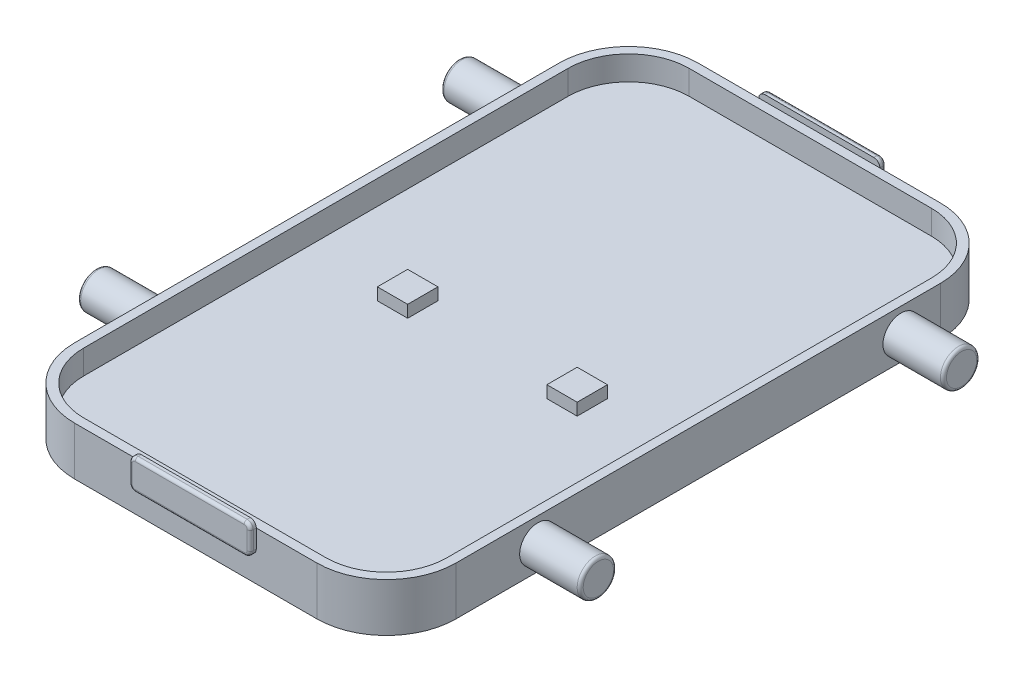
from build123d import *

# Parameters (mm, degrees)
SKETCH_1_W             = 63
SKETCH_1_H             = 103
EXTRUDE_1_DEPTH        = 4
FILLET_1_R             = 11.5
SKETCH_2_R             = 3
EXTRUDE_2_DEPTH        = 41.5
CUT_EXTRUDE_1_DEPTH    = 4
SKETCH_4_W             = 20
SKETCH_4_H             = 5
EXTRUDE_3_DEPTH        = 1
FILLET_2_R             = 1
FILLET_2_OF_MIRROR_1_R = 1
EXTRUDE_4_DEPTH        = 3
EXTRUDE_4_DEPTH_BACK   = 10
SKETCH_5_R             = 2.5
SKETCH_7_W             = 5
SKETCH_7_H             = 5
EXTRUDE_5_DEPTH        = 2
FILLET_3_R             = 0.5


with BuildPart() as part:
    # Sketch 1 → Extrude 1 (new, symmetric)
    with BuildSketch(Plane(origin=(0, 0, 0), x_dir=(1, 0, 0), z_dir=(0, 1, 0))):
        Rectangle(SKETCH_1_W, SKETCH_1_H)
    extrude(amount=EXTRUDE_1_DEPTH, both=True)

    # Fillet 1
    fillet_1_edges = [part.edges().sort_by_distance(p)[0] for p in [
        (-31.5, 0, -51.5),
        (31.5, 0, -51.5),
        (31.5, 0, 51.5),
        (-31.5, 0, 51.5),
    ]]
    fillet(fillet_1_edges, radius=FILLET_1_R)

    # Sketch 2 → Extrude 2 (add, symmetric)
    with BuildSketch(Plane(origin=(0, 0, 0), x_dir=(0, 0, -1), z_dir=(1, 0, 0))):
        with Locations(Location((-26.5, 0, 0), (0, 0, 180))):
            Circle(SKETCH_2_R)
        with Locations(Location((33.5, 0, 0), (0, 0, 180))):
            Circle(SKETCH_2_R)
    extrude(amount=EXTRUDE_2_DEPTH, both=True)

    # Sketch 3 → Cut-Extrude 1 (cut)
    with BuildSketch(Plane(origin=(0, 4, 0), x_dir=(1, 0, 0), z_dir=(0, 1, 0))):
        with BuildLine():
            Line((20, 50), (-20, 50))
            ThreePointArc((-20, 50), (-27.071067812, 47.071067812), (-30, 40))
            Line((-30, 40), (-30, -40))
            ThreePointArc((-30, -40), (-27.071067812, -47.071067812), (-20, -50))
            Line((-20, -50), (20, -50))
            ThreePointArc((20, -50), (27.071067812, -47.071067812), (30, -40))
            Line((30, -40), (30, 40))
            ThreePointArc((30, 40), (27.071067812, 47.071067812), (20, 50))
        make_face()
    extrude(amount=-CUT_EXTRUDE_1_DEPTH, mode=Mode.SUBTRACT)

    # Sketch 4 → Extrude 3 (add)
    with BuildSketch(Plane.XY.offset(51.5)):
        with Locations((0, 2.5)):
            Rectangle(SKETCH_4_W, SKETCH_4_H)
    extrude_3 = extrude(amount=EXTRUDE_3_DEPTH)

    # Fillet 2
    fillet_2_edges = [part.edges().sort_by_distance(p)[0] for p in [
        (-10, 5, 52),
        (-10, 0, 52),
        (10, 0, 52),
        (10, 5, 52),
    ]]
    fillet(fillet_2_edges, radius=FILLET_2_R)

    # Mirror 1: Extrude 3 across plane
    add(extrude_3.mirror(Plane.XY))

    # Fillet 2 of Mirror 1
    fillet_2_of_mirror_1_edges = [part.edges().sort_by_distance(p)[0] for p in [
        (-10, 5, -52),
        (-10, 0, -52),
        (10, 0, -52),
        (10, 5, -52),
    ]]
    fillet(fillet_2_of_mirror_1_edges, radius=FILLET_2_OF_MIRROR_1_R)

    # Sketch 5 → Extrude 4 (add, two sides: drawn at the far end of the back side and taken through both)
    with BuildSketch(Plane(origin=(0, 0, -51.5), x_dir=(-1, 0, 0), z_dir=(0, 0, -1)).offset(-EXTRUDE_4_DEPTH_BACK)):
        with Locations((17.5, -4)):
            Circle(SKETCH_5_R)
    extrude(amount=EXTRUDE_4_DEPTH + EXTRUDE_4_DEPTH_BACK)

    # Sketch 6 → Revolve 1 (revolve)
    with BuildSketch(Plane.XY.offset(-41.5)):
        with BuildLine():
            Line((-15, -4), (-20, -4))
            ThreePointArc((-20, -4), (-17.5, -6.5), (-15, -4))
        make_face()
    revolve(axis=Axis((-20.835379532, -4, -41.5), (1, 0, 0)))

    # Sketch 7 → Extrude 5 (add)
    with BuildSketch(Plane(origin=(0, 0, 0), x_dir=(1, 0, 0), z_dir=(0, 1, 0))):
        with Locations((-14, -2.5)):
            Rectangle(SKETCH_7_W, SKETCH_7_H)
        with Locations((14, -2.5)):
            Rectangle(SKETCH_7_W, SKETCH_7_H)
    extrude(amount=EXTRUDE_5_DEPTH)

    # Fillet 3
    fillet_3_edges = [part.edges().sort_by_distance(p)[0] for p in [
        (0, 0, -52.5),
        (10, 2.5, -52.5),
        (-10, 2.5, -52.5),
        (0, 5, -52.5),
        (-9.707106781, 0.292893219, -52.5),
        (-9.707106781, 4.707106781, -52.5),
        (9.707106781, 4.707106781, -52.5),
        (9.707106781, 0.292893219, -52.5),
        (-15, -4, -54.5),
        (-41.5, 0, 23.5),
        (41.5, 0, 23.5),
        (-41.5, 0, -36.5),
        (41.5, 0, -36.5),
        (10, 2.5, 52.5),
        (0, 0, 52.5),
        (-10, 2.5, 52.5),
        (0, 5, 52.5),
        (-9.707106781, 0.292893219, 52.5),
        (-9.707106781, 4.707106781, 52.5),
        (9.707106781, 4.707106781, 52.5),
        (9.707106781, 0.292893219, 52.5),
    ]]
    fillet(fillet_3_edges, radius=FILLET_3_R)


solid = part.part
